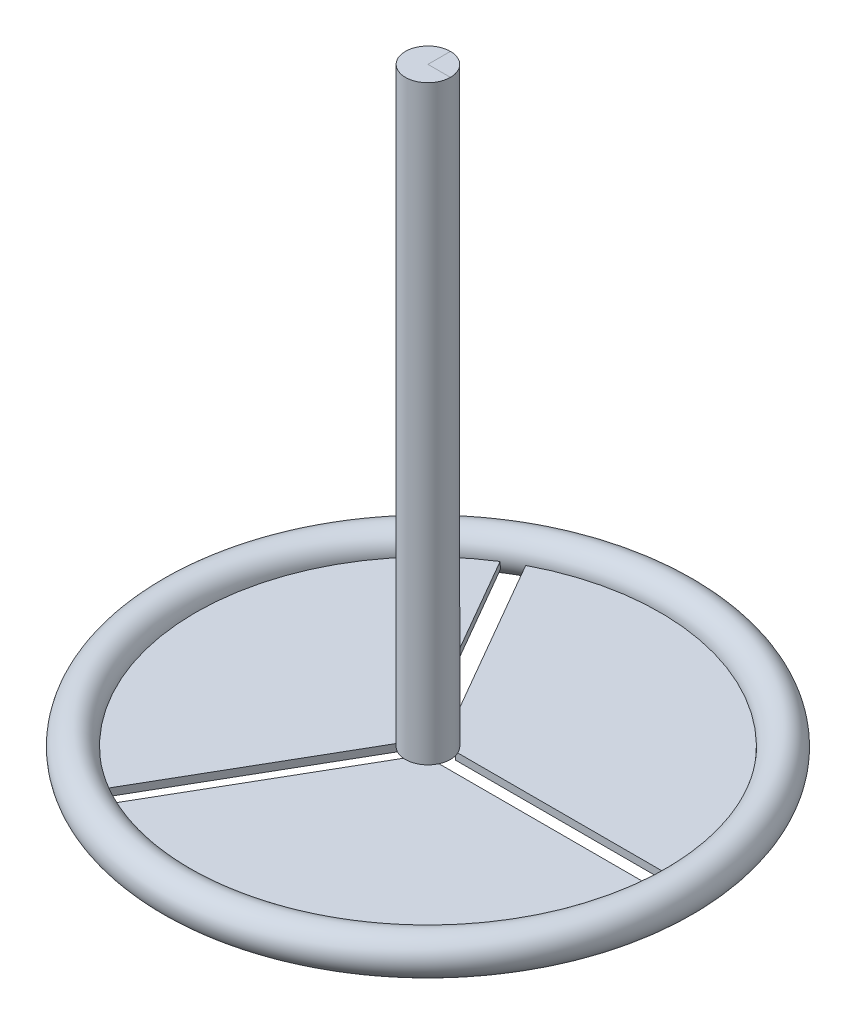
ISO-10303-21;
HEADER;
FILE_DESCRIPTION(('STEP AP214'),'2;1');
FILE_NAME('part.step','',(''),(''),'','','');
FILE_SCHEMA(('AUTOMOTIVE_DESIGN { 1 0 10303 214 1 1 1 1 }'));
ENDSEC;
DATA;
#1=APPLICATION_CONTEXT('core data for automotive mechanical design processes');
#2=APPLICATION_PROTOCOL_DEFINITION('international standard','automotive_design',2000,#1);
#3=PRODUCT_CONTEXT('',#1,'mechanical');
#4=PRODUCT('Part','Part','',(#3));
#5=PRODUCT_RELATED_PRODUCT_CATEGORY('part','',(#4));
#6=PRODUCT_DEFINITION_FORMATION('','',#4);
#7=PRODUCT_DEFINITION_CONTEXT('part definition',#1,'design');
#8=PRODUCT_DEFINITION('design','',#6,#7);
#9=PRODUCT_DEFINITION_SHAPE('','',#8);
#10=(LENGTH_UNIT() NAMED_UNIT(*) SI_UNIT(.MILLI.,.METRE.));
#11=(NAMED_UNIT(*) PLANE_ANGLE_UNIT() SI_UNIT($,.RADIAN.));
#12=(NAMED_UNIT(*) SI_UNIT($,.STERADIAN.) SOLID_ANGLE_UNIT());
#13=UNCERTAINTY_MEASURE_WITH_UNIT(LENGTH_MEASURE(1.E-05),#10,'distance_accuracy_value','');
#14=(GEOMETRIC_REPRESENTATION_CONTEXT(3) GLOBAL_UNCERTAINTY_ASSIGNED_CONTEXT((#13)) GLOBAL_UNIT_ASSIGNED_CONTEXT((#10,
#11,#12)) REPRESENTATION_CONTEXT('',''));
#15=CARTESIAN_POINT('',(0.,0.,0.));
#16=DIRECTION('',(0.,0.,1.));
#17=DIRECTION('',(1.,0.,0.));
#18=AXIS2_PLACEMENT_3D('',#15,#16,#17);
#19=CARTESIAN_POINT('',(0.,400.05,0.));
#20=DIRECTION('',(0.,1.,0.));
#21=DIRECTION('',(0.,0.,1.));
#22=AXIS2_PLACEMENT_3D('',#19,#20,#21);
#23=PLANE('',#22);
#24=DIRECTION('',(-1.,0.,0.));
#25=VECTOR('',#24,1.);
#26=CARTESIAN_POINT('',(0.,400.05,0.));
#27=LINE('',#26,#25);
#28=CARTESIAN_POINT('',(15.24,400.05,0.));
#29=VERTEX_POINT('',#28);
#30=CARTESIAN_POINT('',(0.,400.05,0.));
#31=VERTEX_POINT('',#30);
#32=EDGE_CURVE('E45',#29,#31,#27,.T.);
#33=ORIENTED_EDGE('',*,*,#32,.T.);
#34=DIRECTION('',(0.,0.,-1.));
#35=VECTOR('',#34,1.);
#36=CARTESIAN_POINT('',(0.,400.05,0.));
#37=LINE('',#36,#35);
#38=CARTESIAN_POINT('',(0.,400.05,-15.24));
#39=VERTEX_POINT('',#38);
#40=EDGE_CURVE('E11',#31,#39,#37,.T.);
#41=ORIENTED_EDGE('',*,*,#40,.T.);
#42=CARTESIAN_POINT('',(0.,400.05,0.));
#43=DIRECTION('',(0.,1.,0.));
#44=DIRECTION('',(0.,0.,1.));
#45=AXIS2_PLACEMENT_3D('',#42,#43,#44);
#46=CIRCLE('',#45,15.24);
#47=EDGE_CURVE('E490',#39,#29,#46,.T.);
#48=ORIENTED_EDGE('',*,*,#47,.T.);
#49=EDGE_LOOP('',(#33,#41,#48));
#50=FACE_BOUND('',#49,.T.);
#51=ADVANCED_FACE('F36',(#50),#23,.T.);
#52=CARTESIAN_POINT('',(0.,0.,0.));
#53=DIRECTION('',(0.,-1.,0.));
#54=DIRECTION('',(0.,0.,-1.));
#55=AXIS2_PLACEMENT_3D('',#52,#53,#54);
#56=PLANE('',#55);
#57=DIRECTION('',(1.,0.,0.));
#58=VECTOR('',#57,1.);
#59=CARTESIAN_POINT('',(161.232600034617,0.,-6.34959910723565));
#60=LINE('',#59,#58);
#61=CARTESIAN_POINT('',(13.8542481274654,0.,-6.34959910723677));
#62=VERTEX_POINT('',#61);
#63=CARTESIAN_POINT('',(157.171793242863,0.,-6.34959910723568));
#64=VERTEX_POINT('',#63);
#65=EDGE_CURVE('E191',#62,#64,#60,.T.);
#66=ORIENTED_EDGE('',*,*,#65,.T.);
#67=CARTESIAN_POINT('',(0.,0.,0.));
#68=DIRECTION('',(0.,1.,0.));
#69=DIRECTION('',(0.,0.,1.));
#70=AXIS2_PLACEMENT_3D('',#67,#68,#69);
#71=CIRCLE('',#70,157.3);
#72=CARTESIAN_POINT('',(-73.0869824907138,0.,-139.289565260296));
#73=VERTEX_POINT('',#72);
#74=EDGE_CURVE('E171',#64,#73,#71,.T.);
#75=ORIENTED_EDGE('',*,*,#74,.T.);
#76=DIRECTION('',(0.499999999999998,0.,0.86602540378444));
#77=VECTOR('',#76,1.);
#78=CARTESIAN_POINT('',(-75.0460333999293,0.,-142.682740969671));
#79=LINE('',#78,#77);
#80=CARTESIAN_POINT('',(-1.42820993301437,0.,-15.1729303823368));
#81=VERTEX_POINT('',#80);
#82=EDGE_CURVE('E189',#73,#81,#79,.T.);
#83=ORIENTED_EDGE('',*,*,#82,.T.);
#84=CARTESIAN_POINT('',(0.,0.,0.));
#85=DIRECTION('',(0.,1.,0.));
#86=DIRECTION('',(0.,0.,1.));
#87=AXIS2_PLACEMENT_3D('',#84,#85,#86);
#88=CIRCLE('',#87,15.24);
#89=EDGE_CURVE('E160',#62,#81,#88,.T.);
#90=ORIENTED_EDGE('',*,*,#89,.F.);
#91=EDGE_LOOP('',(#66,#75,#83,#90));
#92=FACE_BOUND('',#91,.T.);
#93=ADVANCED_FACE('F302',(#92),#56,.F.);
#94=DIRECTION('',(-0.499999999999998,0.,-0.86602540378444));
#95=VECTOR('',#94,1.);
#96=CARTESIAN_POINT('',(-86.115214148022,0.,-136.456727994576));
#97=LINE('',#96,#95);
#98=CARTESIAN_POINT('',(-12.4260381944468,0.,-8.82333127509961));
#99=VERTEX_POINT('',#98);
#100=CARTESIAN_POINT('',(-84.0848107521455,0.,-132.939966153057));
#101=VERTEX_POINT('',#100);
#102=EDGE_CURVE('E502',#99,#101,#97,.T.);
#103=ORIENTED_EDGE('',*,*,#102,.T.);
#104=CARTESIAN_POINT('',(-84.0848107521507,0.,132.939966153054));
#105=VERTEX_POINT('',#104);
#106=EDGE_CURVE('E170',#101,#105,#71,.T.);
#107=ORIENTED_EDGE('',*,*,#106,.T.);
#108=DIRECTION('',(0.500000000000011,0.,-0.866025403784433));
#109=VECTOR('',#108,1.);
#110=CARTESIAN_POINT('',(-86.0438616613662,0.,136.333141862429));
#111=LINE('',#110,#109);
#112=CARTESIAN_POINT('',(-12.4260381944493,0.,8.82333127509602));
#113=VERTEX_POINT('',#112);
#114=EDGE_CURVE('E196',#105,#113,#111,.T.);
#115=ORIENTED_EDGE('',*,*,#114,.T.);
#116=EDGE_CURVE('E484',#99,#113,#88,.T.);
#117=ORIENTED_EDGE('',*,*,#116,.F.);
#118=EDGE_LOOP('',(#103,#107,#115,#117));
#119=FACE_BOUND('',#118,.T.);
#120=ADVANCED_FACE('F306',(#119),#56,.F.);
#121=CARTESIAN_POINT('',(0.,-5.00000000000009,0.));
#122=DIRECTION('',(0.,-1.,0.));
#123=DIRECTION('',(0.,0.,-1.));
#124=AXIS2_PLACEMENT_3D('',#121,#122,#123);
#125=PLANE('',#124);
#126=CARTESIAN_POINT('',(0.,-5.00000000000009,0.));
#127=DIRECTION('',(0.,1.,0.));
#128=DIRECTION('',(0.,0.,1.));
#129=AXIS2_PLACEMENT_3D('',#126,#127,#128);
#130=CIRCLE('',#129,158.32566918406);
#131=CARTESIAN_POINT('',(158.198293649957,-5.00000000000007,-6.34959910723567));
#132=VERTEX_POINT('',#131);
#133=CARTESIAN_POINT('',(-73.6002326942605,-5.00000000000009,-140.178540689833));
#134=VERTEX_POINT('',#133);
#135=EDGE_CURVE('E465',#132,#134,#130,.T.);
#136=ORIENTED_EDGE('',*,*,#135,.F.);
#137=DIRECTION('',(1.,0.,0.));
#138=VECTOR('',#137,1.);
#139=CARTESIAN_POINT('',(161.232600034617,-5.00000000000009,-6.34959910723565));
#140=LINE('',#139,#138);
#141=CARTESIAN_POINT('',(12.4436124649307,-5.00000000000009,-6.34959910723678));
#142=VERTEX_POINT('',#141);
#143=EDGE_CURVE('E185',#142,#132,#140,.T.);
#144=ORIENTED_EDGE('',*,*,#143,.F.);
#145=CARTESIAN_POINT('',(0.,-5.00000000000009,0.));
#146=DIRECTION('',(0.,-1.,0.));
#147=DIRECTION('',(0.,0.,-1.));
#148=AXIS2_PLACEMENT_3D('',#145,#146,#147);
#149=CIRCLE('',#148,13.97);
#150=CARTESIAN_POINT('',(-0.722892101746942,-5.00000000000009,-13.9512840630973));
#151=VERTEX_POINT('',#150);
#152=EDGE_CURVE('E209',#151,#142,#149,.T.);
#153=ORIENTED_EDGE('',*,*,#152,.F.);
#154=DIRECTION('',(0.499999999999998,0.,0.86602540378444));
#155=VECTOR('',#154,1.);
#156=CARTESIAN_POINT('',(-75.0460333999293,-5.00000000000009,-142.682740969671));
#157=LINE('',#156,#155);
#158=EDGE_CURVE('E506',#134,#151,#157,.T.);
#159=ORIENTED_EDGE('',*,*,#158,.F.);
#160=EDGE_LOOP('',(#136,#144,#153,#159));
#161=FACE_BOUND('',#160,.T.);
#162=ADVANCED_FACE('F347',(#161),#125,.T.);
#163=CARTESIAN_POINT('',(-84.5980609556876,-4.99999999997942,-133.828941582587));
#164=VERTEX_POINT('',#163);
#165=CARTESIAN_POINT('',(-84.5980609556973,-5.00000000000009,133.828941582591));
#166=VERTEX_POINT('',#165);
#167=EDGE_CURVE('E272',#164,#166,#130,.T.);
#168=ORIENTED_EDGE('',*,*,#167,.F.);
#169=DIRECTION('',(-0.499999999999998,0.,-0.86602540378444));
#170=VECTOR('',#169,1.);
#171=CARTESIAN_POINT('',(-86.115214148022,-5.00000000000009,-136.456727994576));
#172=LINE('',#171,#170);
#173=CARTESIAN_POINT('',(-11.7207203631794,-5.00000000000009,-7.60168495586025));
#174=VERTEX_POINT('',#173);
#175=EDGE_CURVE('E504',#174,#164,#172,.T.);
#176=ORIENTED_EDGE('',*,*,#175,.F.);
#177=CARTESIAN_POINT('',(-11.7207203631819,-5.00000000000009,7.60168495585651));
#178=VERTEX_POINT('',#177);
#179=EDGE_CURVE('E206',#178,#174,#149,.T.);
#180=ORIENTED_EDGE('',*,*,#179,.F.);
#181=DIRECTION('',(0.500000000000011,0.,-0.866025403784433));
#182=VECTOR('',#181,1.);
#183=CARTESIAN_POINT('',(-86.0438616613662,-5.00000000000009,136.333141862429));
#184=LINE('',#183,#182);
#185=EDGE_CURVE('E179',#166,#178,#184,.T.);
#186=ORIENTED_EDGE('',*,*,#185,.F.);
#187=EDGE_LOOP('',(#168,#176,#180,#186));
#188=FACE_BOUND('',#187,.T.);
#189=ADVANCED_FACE('F341',(#188),#125,.T.);
#190=DIRECTION('',(-0.500000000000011,0.,0.866025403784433));
#191=VECTOR('',#190,1.);
#192=CARTESIAN_POINT('',(-75.1173858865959,0.,142.806327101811));
#193=LINE('',#192,#191);
#194=CARTESIAN_POINT('',(-1.42820993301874,0.,15.1729303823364));
#195=VERTEX_POINT('',#194);
#196=CARTESIAN_POINT('',(-73.0869824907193,0.,139.289565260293));
#197=VERTEX_POINT('',#196);
#198=EDGE_CURVE('E167',#195,#197,#193,.T.);
#199=ORIENTED_EDGE('',*,*,#198,.T.);
#200=CARTESIAN_POINT('',(157.171793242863,0.,6.34959910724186));
#201=VERTEX_POINT('',#200);
#202=EDGE_CURVE('E153',#197,#201,#71,.T.);
#203=ORIENTED_EDGE('',*,*,#202,.T.);
#204=DIRECTION('',(-1.,0.,0.));
#205=VECTOR('',#204,1.);
#206=CARTESIAN_POINT('',(161.089895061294,0.,6.34959910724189));
#207=LINE('',#206,#205);
#208=CARTESIAN_POINT('',(13.8542481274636,0.,6.34959910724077));
#209=VERTEX_POINT('',#208);
#210=EDGE_CURVE('E164',#201,#209,#207,.T.);
#211=ORIENTED_EDGE('',*,*,#210,.T.);
#212=EDGE_CURVE('E226',#195,#209,#88,.T.);
#213=ORIENTED_EDGE('',*,*,#212,.F.);
#214=EDGE_LOOP('',(#199,#203,#211,#213));
#215=FACE_BOUND('',#214,.T.);
#216=ADVANCED_FACE('F38',(#215),#56,.F.);
#217=CARTESIAN_POINT('',(0.,0.,0.));
#218=DIRECTION('',(0.,-1.,0.));
#219=DIRECTION('',(0.,0.,-1.));
#220=AXIS2_PLACEMENT_3D('',#217,#218,#219);
#221=CYLINDRICAL_SURFACE('',#220,13.97);
#222=ORIENTED_EDGE('',*,*,#152,.T.);
#223=DIRECTION('',(0.,-1.,0.));
#224=VECTOR('',#223,1.);
#225=CARTESIAN_POINT('',(12.4436124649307,0.,-6.34959910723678));
#226=LINE('',#225,#224);
#227=CARTESIAN_POINT('',(12.4436124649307,0.,-6.34959910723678));
#228=VERTEX_POINT('',#227);
#229=EDGE_CURVE('E224',#142,#228,#226,.F.);
#230=ORIENTED_EDGE('',*,*,#229,.T.);
#231=CARTESIAN_POINT('',(0.,0.,0.));
#232=DIRECTION('',(0.,-1.,0.));
#233=DIRECTION('',(0.,0.,-1.));
#234=AXIS2_PLACEMENT_3D('',#231,#232,#233);
#235=CIRCLE('',#234,13.97);
#236=CARTESIAN_POINT('',(-0.722892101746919,0.,-13.9512840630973));
#237=VERTEX_POINT('',#236);
#238=EDGE_CURVE('E204',#237,#228,#235,.T.);
#239=ORIENTED_EDGE('',*,*,#238,.F.);
#240=DIRECTION('',(0.,-1.,0.));
#241=VECTOR('',#240,1.);
#242=CARTESIAN_POINT('',(-0.722892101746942,0.,-13.9512840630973));
#243=LINE('',#242,#241);
#244=EDGE_CURVE('E215',#237,#151,#243,.T.);
#245=ORIENTED_EDGE('',*,*,#244,.T.);
#246=EDGE_LOOP('',(#222,#230,#239,#245));
#247=FACE_BOUND('',#246,.T.);
#248=ADVANCED_FACE('F380',(#247),#221,.F.);
#249=ORIENTED_EDGE('',*,*,#179,.T.);
#250=DIRECTION('',(0.,-1.,0.));
#251=VECTOR('',#250,1.);
#252=CARTESIAN_POINT('',(-11.7207203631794,0.,-7.60168495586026));
#253=LINE('',#252,#251);
#254=CARTESIAN_POINT('',(-11.7207203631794,0.,-7.60168495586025));
#255=VERTEX_POINT('',#254);
#256=EDGE_CURVE('E218',#174,#255,#253,.F.);
#257=ORIENTED_EDGE('',*,*,#256,.T.);
#258=CARTESIAN_POINT('',(-11.7207203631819,0.,7.60168495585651));
#259=VERTEX_POINT('',#258);
#260=EDGE_CURVE('E200',#259,#255,#235,.T.);
#261=ORIENTED_EDGE('',*,*,#260,.F.);
#262=DIRECTION('',(0.,-1.,0.));
#263=VECTOR('',#262,1.);
#264=CARTESIAN_POINT('',(-11.7207203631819,0.,7.60168495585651));
#265=LINE('',#264,#263);
#266=EDGE_CURVE('E203',#259,#178,#265,.T.);
#267=ORIENTED_EDGE('',*,*,#266,.T.);
#268=EDGE_LOOP('',(#249,#257,#261,#267));
#269=FACE_BOUND('',#268,.T.);
#270=ADVANCED_FACE('F381',(#269),#221,.F.);
#271=CARTESIAN_POINT('',(-73.6002326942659,-5.00000000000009,140.17854068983));
#272=VERTEX_POINT('',#271);
#273=CARTESIAN_POINT('',(158.198293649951,-5.00000000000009,6.34959910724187));
#274=VERTEX_POINT('',#273);
#275=EDGE_CURVE('E156',#272,#274,#130,.T.);
#276=ORIENTED_EDGE('',*,*,#275,.F.);
#277=DIRECTION('',(-0.500000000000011,0.,0.866025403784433));
#278=VECTOR('',#277,1.);
#279=CARTESIAN_POINT('',(-75.1173858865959,-5.00000000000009,142.806327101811));
#280=LINE('',#279,#278);
#281=CARTESIAN_POINT('',(-0.722892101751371,-5.00000000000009,13.9512840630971));
#282=VERTEX_POINT('',#281);
#283=EDGE_CURVE('E176',#282,#272,#280,.T.);
#284=ORIENTED_EDGE('',*,*,#283,.F.);
#285=CARTESIAN_POINT('',(12.4436124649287,-5.00000000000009,6.34959910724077));
#286=VERTEX_POINT('',#285);
#287=EDGE_CURVE('E197',#286,#282,#149,.T.);
#288=ORIENTED_EDGE('',*,*,#287,.F.);
#289=DIRECTION('',(-1.,0.,0.));
#290=VECTOR('',#289,1.);
#291=CARTESIAN_POINT('',(161.089895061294,-5.00000000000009,6.34959910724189));
#292=LINE('',#291,#290);
#293=EDGE_CURVE('E188',#274,#286,#292,.T.);
#294=ORIENTED_EDGE('',*,*,#293,.F.);
#295=EDGE_LOOP('',(#276,#284,#288,#294));
#296=FACE_BOUND('',#295,.T.);
#297=ADVANCED_FACE('F349',(#296),#125,.T.);
#298=CARTESIAN_POINT('',(12.4436124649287,0.,6.34959910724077));
#299=VERTEX_POINT('',#298);
#300=CARTESIAN_POINT('',(-0.722892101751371,0.,13.9512840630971));
#301=VERTEX_POINT('',#300);
#302=EDGE_CURVE('E205',#299,#301,#235,.T.);
#303=ORIENTED_EDGE('',*,*,#302,.F.);
#304=DIRECTION('',(0.,-1.,0.));
#305=VECTOR('',#304,1.);
#306=CARTESIAN_POINT('',(12.4436124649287,0.,6.34959910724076));
#307=LINE('',#306,#305);
#308=EDGE_CURVE('E221',#299,#286,#307,.T.);
#309=ORIENTED_EDGE('',*,*,#308,.T.);
#310=ORIENTED_EDGE('',*,*,#287,.T.);
#311=DIRECTION('',(0.,-1.,0.));
#312=VECTOR('',#311,1.);
#313=CARTESIAN_POINT('',(-0.722892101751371,0.,13.9512840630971));
#314=LINE('',#313,#312);
#315=EDGE_CURVE('E212',#282,#301,#314,.F.);
#316=ORIENTED_EDGE('',*,*,#315,.T.);
#317=EDGE_LOOP('',(#303,#309,#310,#316));
#318=FACE_BOUND('',#317,.T.);
#319=ADVANCED_FACE('F372',(#318),#221,.F.);
#320=CARTESIAN_POINT('',(-75.1173858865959,0.,142.806327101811));
#321=DIRECTION('',(0.866025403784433,0.,0.500000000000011));
#322=DIRECTION('',(0.500000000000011,0.,-0.866025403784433));
#323=AXIS2_PLACEMENT_3D('',#320,#321,#322);
#324=PLANE('',#323);
#325=ORIENTED_EDGE('',*,*,#283,.T.);
#326=CARTESIAN_POINT('',(-73.6002755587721,-5.00020000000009,140.178614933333));
#327=CARTESIAN_POINT('',(-73.5293948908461,-4.66959465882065,140.055846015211));
#328=CARTESIAN_POINT('',(-73.4655773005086,-4.33292979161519,139.94531070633));
#329=CARTESIAN_POINT('',(-73.3524152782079,-3.6497825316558,139.749308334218));
#330=CARTESIAN_POINT('',(-73.3030795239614,-3.30329438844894,139.663856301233));
#331=CARTESIAN_POINT('',(-73.2200143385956,-2.60905785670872,139.519983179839));
#332=CARTESIAN_POINT('',(-73.18603769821,-2.2614274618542,139.461133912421));
#333=CARTESIAN_POINT('',(-73.1327455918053,-1.56189652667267,139.368829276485));
#334=CARTESIAN_POINT('',(-73.1134197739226,-1.20999918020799,139.335355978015));
#335=CARTESIAN_POINT('',(-73.0966525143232,-0.714754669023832,139.306314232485));
#336=CARTESIAN_POINT('',(-73.0930330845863,-0.572158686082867,139.300045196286));
#337=CARTESIAN_POINT('',(-73.0881935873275,-0.286314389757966,139.291662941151));
#338=CARTESIAN_POINT('',(-73.0869817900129,-0.143065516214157,139.289564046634));
#339=CARTESIAN_POINT('',(-73.0869824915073,0.000199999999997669,139.289565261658));
#340=B_SPLINE_CURVE_WITH_KNOTS('',3,(#326,#327,#328,#329,#330,#331,#332,#333,#334,#335,#336,
#337,#338,#339),.UNSPECIFIED.,.F.,.F.,(4,2,2,2,2,2,4),(0.,1.07883504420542,2.15831522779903,
3.21974157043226,4.28041723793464,4.7086913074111,5.13843397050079),.UNSPECIFIED.);
#341=EDGE_CURVE('E168',#272,#197,#340,.T.);
#342=ORIENTED_EDGE('',*,*,#341,.T.);
#343=ORIENTED_EDGE('',*,*,#198,.F.);
#344=EDGE_CURVE('E192',#301,#195,#193,.T.);
#345=ORIENTED_EDGE('',*,*,#344,.F.);
#346=ORIENTED_EDGE('',*,*,#315,.F.);
#347=EDGE_LOOP('',(#325,#342,#343,#345,#346));
#348=FACE_BOUND('',#347,.T.);
#349=ADVANCED_FACE('F377',(#348),#324,.F.);
#350=CARTESIAN_POINT('',(-86.0438616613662,0.,136.333141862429));
#351=DIRECTION('',(-0.866025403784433,0.,-0.500000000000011));
#352=DIRECTION('',(-0.500000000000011,0.,0.866025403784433));
#353=AXIS2_PLACEMENT_3D('',#350,#351,#352);
#354=PLANE('',#353);
#355=ORIENTED_EDGE('',*,*,#114,.F.);
#356=CARTESIAN_POINT('',(-84.0848107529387,0.0002,132.939966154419));
#357=CARTESIAN_POINT('',(-84.0847869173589,-0.359517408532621,132.939924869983));
#358=CARTESIAN_POINT('',(-84.0924517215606,-0.719238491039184,132.953200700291));
#359=CARTESIAN_POINT('',(-84.1230214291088,-1.43629748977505,133.006148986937));
#360=CARTESIAN_POINT('',(-84.1459353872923,-1.79363386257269,133.045837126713));
#361=CARTESIAN_POINT('',(-84.2063564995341,-2.49716768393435,133.150489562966));
#362=CARTESIAN_POINT('',(-84.2436132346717,-2.84345147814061,133.215020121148));
#363=CARTESIAN_POINT('',(-84.3324416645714,-3.52839166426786,133.368875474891));
#364=CARTESIAN_POINT('',(-84.3840032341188,-3.8670532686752,133.458182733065));
#365=CARTESIAN_POINT('',(-84.4661532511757,-4.33545242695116,133.60047073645));
#366=CARTESIAN_POINT('',(-84.490917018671,-4.46936659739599,133.643362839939));
#367=CARTESIAN_POINT('',(-84.5427775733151,-4.73590441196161,133.733187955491));
#368=CARTESIAN_POINT('',(-84.569882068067,-4.86852205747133,133.780134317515));
#369=CARTESIAN_POINT('',(-84.5981038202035,-5.00020000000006,133.829015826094));
#370=B_SPLINE_CURVE_WITH_KNOTS('',3,(#356,#357,#358,#359,#360,#361,#362,#363,#364,#365,#366,
#367,#368,#369),.UNSPECIFIED.,.F.,.F.,(4,2,2,2,2,2,4),(0.,1.07883590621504,2.15831298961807,
3.2197401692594,4.28041796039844,4.70869172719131,5.13843381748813),.UNSPECIFIED.);
#371=EDGE_CURVE('E273',#105,#166,#370,.T.);
#372=ORIENTED_EDGE('',*,*,#371,.T.);
#373=ORIENTED_EDGE('',*,*,#185,.T.);
#374=ORIENTED_EDGE('',*,*,#266,.F.);
#375=EDGE_CURVE('E195',#113,#259,#111,.T.);
#376=ORIENTED_EDGE('',*,*,#375,.F.);
#377=EDGE_LOOP('',(#355,#372,#373,#374,#376));
#378=FACE_BOUND('',#377,.T.);
#379=ADVANCED_FACE('F289',(#378),#354,.F.);
#380=CARTESIAN_POINT('',(-75.0460333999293,0.,-142.682740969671));
#381=DIRECTION('',(0.86602540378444,0.,-0.499999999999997));
#382=DIRECTION('',(-0.499999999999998,0.,-0.86602540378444));
#383=AXIS2_PLACEMENT_3D('',#380,#381,#382);
#384=PLANE('',#383);
#385=ORIENTED_EDGE('',*,*,#82,.F.);
#386=CARTESIAN_POINT('',(-73.0869824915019,0.0002,-139.28956526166));
#387=CARTESIAN_POINT('',(-73.0869586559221,-0.359517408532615,-139.289523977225));
#388=CARTESIAN_POINT('',(-73.0946234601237,-0.719238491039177,-139.302799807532));
#389=CARTESIAN_POINT('',(-73.125193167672,-1.43629748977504,-139.355748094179));
#390=CARTESIAN_POINT('',(-73.1481071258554,-1.79363386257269,-139.395436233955));
#391=CARTESIAN_POINT('',(-73.2085282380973,-2.49716768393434,-139.500088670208));
#392=CARTESIAN_POINT('',(-73.2457849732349,-2.84345147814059,-139.56461922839));
#393=CARTESIAN_POINT('',(-73.3346134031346,-3.52839166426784,-139.718474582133));
#394=CARTESIAN_POINT('',(-73.386174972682,-3.86705326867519,-139.807781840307));
#395=CARTESIAN_POINT('',(-73.4683249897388,-4.33545242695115,-139.950069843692));
#396=CARTESIAN_POINT('',(-73.4930887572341,-4.46936659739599,-139.992961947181));
#397=CARTESIAN_POINT('',(-73.5449493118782,-4.73590441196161,-140.082787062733));
#398=CARTESIAN_POINT('',(-73.5720538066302,-4.86852205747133,-140.129733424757));
#399=CARTESIAN_POINT('',(-73.6002755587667,-5.00020000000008,-140.178614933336));
#400=B_SPLINE_CURVE_WITH_KNOTS('',3,(#386,#387,#388,#389,#390,#391,#392,#393,#394,#395,#396,
#397,#398,#399),.UNSPECIFIED.,.F.,.F.,(4,2,2,2,2,2,4),(0.,1.07883590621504,2.15831298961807,
3.21974016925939,4.28041796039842,4.70869172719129,5.13843381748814),.UNSPECIFIED.);
#401=EDGE_CURVE('E259',#73,#134,#400,.T.);
#402=ORIENTED_EDGE('',*,*,#401,.T.);
#403=ORIENTED_EDGE('',*,*,#158,.T.);
#404=ORIENTED_EDGE('',*,*,#244,.F.);
#405=EDGE_CURVE('E498',#81,#237,#79,.T.);
#406=ORIENTED_EDGE('',*,*,#405,.F.);
#407=EDGE_LOOP('',(#385,#402,#403,#404,#406));
#408=FACE_BOUND('',#407,.T.);
#409=ADVANCED_FACE('F284',(#408),#384,.F.);
#410=CARTESIAN_POINT('',(-86.115214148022,0.,-136.456727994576));
#411=DIRECTION('',(-0.86602540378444,0.,0.499999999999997));
#412=DIRECTION('',(0.499999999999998,0.,0.86602540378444));
#413=AXIS2_PLACEMENT_3D('',#410,#411,#412);
#414=PLANE('',#413);
#415=ORIENTED_EDGE('',*,*,#175,.T.);
#416=CARTESIAN_POINT('',(-84.5981038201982,-5.00020000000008,-133.829015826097));
#417=CARTESIAN_POINT('',(-84.5272231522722,-4.66959465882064,-133.706246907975));
#418=CARTESIAN_POINT('',(-84.4634055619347,-4.33292979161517,-133.595711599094));
#419=CARTESIAN_POINT('',(-84.3502435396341,-3.64978253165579,-133.399709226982));
#420=CARTESIAN_POINT('',(-84.3009077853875,-3.30329438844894,-133.314257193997));
#421=CARTESIAN_POINT('',(-84.2178426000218,-2.60905785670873,-133.170384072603));
#422=CARTESIAN_POINT('',(-84.1838659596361,-2.26142746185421,-133.111534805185));
#423=CARTESIAN_POINT('',(-84.1305738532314,-1.56189652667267,-133.01923016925));
#424=CARTESIAN_POINT('',(-84.1112480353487,-1.20999918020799,-132.985756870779));
#425=CARTESIAN_POINT('',(-84.0944807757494,-0.714754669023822,-132.956715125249));
#426=CARTESIAN_POINT('',(-84.0908613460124,-0.572158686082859,-132.950446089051));
#427=CARTESIAN_POINT('',(-84.0860218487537,-0.286314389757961,-132.942063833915));
#428=CARTESIAN_POINT('',(-84.084810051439,-0.143065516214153,-132.939964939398));
#429=CARTESIAN_POINT('',(-84.0848107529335,0.000200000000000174,-132.939966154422));
#430=B_SPLINE_CURVE_WITH_KNOTS('',3,(#416,#417,#418,#419,#420,#421,#422,#423,#424,#425,#426,
#427,#428,#429),.UNSPECIFIED.,.F.,.F.,(4,2,2,2,2,2,4),(0.,1.07883504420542,2.15831522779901,
3.21974157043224,4.28041723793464,4.7086913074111,5.13843397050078),.UNSPECIFIED.);
#431=EDGE_CURVE('E266',#164,#101,#430,.T.);
#432=ORIENTED_EDGE('',*,*,#431,.T.);
#433=ORIENTED_EDGE('',*,*,#102,.F.);
#434=EDGE_CURVE('E500',#255,#99,#97,.T.);
#435=ORIENTED_EDGE('',*,*,#434,.F.);
#436=ORIENTED_EDGE('',*,*,#256,.F.);
#437=EDGE_LOOP('',(#415,#432,#433,#435,#436));
#438=FACE_BOUND('',#437,.T.);
#439=ADVANCED_FACE('F280',(#438),#414,.F.);
#440=CARTESIAN_POINT('',(161.232600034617,0.,-6.34959910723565));
#441=DIRECTION('',(0.,0.,-1.));
#442=DIRECTION('',(-1.,0.,0.));
#443=AXIS2_PLACEMENT_3D('',#440,#441,#442);
#444=PLANE('',#443);
#445=ORIENTED_EDGE('',*,*,#143,.T.);
#446=CARTESIAN_POINT('',(157.390886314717,-2.34787371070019,-6.34959910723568));
#447=CARTESIAN_POINT('',(157.324916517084,-1.99748321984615,-6.34959910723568));
#448=CARTESIAN_POINT('',(157.273732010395,-1.64435208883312,-6.34959910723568));
#449=CARTESIAN_POINT('',(157.201258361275,-0.934919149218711,-6.34959910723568));
#450=CARTESIAN_POINT('',(157.179977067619,-0.578616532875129,-6.34959910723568));
#451=CARTESIAN_POINT('',(157.167488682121,0.134892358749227,-6.34959910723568));
#452=CARTESIAN_POINT('',(157.176313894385,0.492099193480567,-6.34959910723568));
#453=CARTESIAN_POINT('',(157.224044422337,1.20449770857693,-6.34959910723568));
#454=CARTESIAN_POINT('',(157.262949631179,1.55968939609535,-6.34959910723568));
#455=CARTESIAN_POINT('',(157.370535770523,2.26535548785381,-6.34959910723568));
#456=CARTESIAN_POINT('',(157.439202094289,2.61583211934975,-6.34959910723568));
#457=CARTESIAN_POINT('',(157.605818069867,3.30976015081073,-6.34959910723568));
#458=CARTESIAN_POINT('',(157.703768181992,3.65321144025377,-6.34959910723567));
#459=CARTESIAN_POINT('',(157.928223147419,4.3305561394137,-6.34959910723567));
#460=CARTESIAN_POINT('',(158.054720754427,4.66445195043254,-6.34959910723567));
#461=CARTESIAN_POINT('',(158.335381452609,5.32040484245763,-6.34959910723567));
#462=CARTESIAN_POINT('',(158.489544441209,5.64246196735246,-6.34959910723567));
#463=CARTESIAN_POINT('',(158.824485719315,6.27254565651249,-6.34959910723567));
#464=CARTESIAN_POINT('',(159.005271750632,6.580568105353,-6.34959910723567));
#465=CARTESIAN_POINT('',(159.392136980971,7.18029744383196,-6.34959910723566));
#466=CARTESIAN_POINT('',(159.598216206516,7.47200431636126,-6.34959910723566));
#467=CARTESIAN_POINT('',(160.034208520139,8.03704581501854,-6.34959910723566));
#468=CARTESIAN_POINT('',(160.264122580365,8.31037969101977,-6.34959910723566));
#469=CARTESIAN_POINT('',(160.746140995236,8.83672579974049,-6.34959910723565));
#470=CARTESIAN_POINT('',(160.998245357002,9.08973802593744,-6.34959910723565));
#471=CARTESIAN_POINT('',(161.523020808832,9.57380598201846,-6.34959910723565));
#472=CARTESIAN_POINT('',(161.79570506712,9.80484743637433,-6.34959910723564));
#473=CARTESIAN_POINT('',(162.359556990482,10.2431524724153,-6.34959910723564));
#474=CARTESIAN_POINT('',(162.650724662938,10.4504160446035,-6.34959910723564));
#475=CARTESIAN_POINT('',(163.249473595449,10.8396983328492,-6.34959910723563));
#476=CARTESIAN_POINT('',(163.557054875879,11.0217170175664,-6.34959910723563));
#477=CARTESIAN_POINT('',(164.186445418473,11.3592214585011,-6.34959910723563));
#478=CARTESIAN_POINT('',(164.508254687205,11.5147072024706,-6.34959910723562));
#479=CARTESIAN_POINT('',(165.164061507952,11.7981520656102,-6.34959910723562));
#480=CARTESIAN_POINT('',(165.498067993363,11.9260905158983,-6.34959910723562));
#481=CARTESIAN_POINT('',(166.175667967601,12.1533874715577,-6.34959910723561));
#482=CARTESIAN_POINT('',(166.519261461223,12.2527459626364,-6.34959910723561));
#483=CARTESIAN_POINT('',(167.213594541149,12.422179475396,-6.3495991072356));
#484=CARTESIAN_POINT('',(167.564334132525,12.4922544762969,-6.3495991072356));
#485=CARTESIAN_POINT('',(168.27046797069,12.6026245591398,-6.34959910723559));
#486=CARTESIAN_POINT('',(168.62586221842,12.6429196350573,-6.34959910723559));
#487=CARTESIAN_POINT('',(169.338949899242,12.6934560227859,-6.34959910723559));
#488=CARTESIAN_POINT('',(169.696644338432,12.70368313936,-6.34959910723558));
#489=CARTESIAN_POINT('',(170.411623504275,12.6939700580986,-6.34959910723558));
#490=CARTESIAN_POINT('',(170.768908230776,12.6740298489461,-6.34959910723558));
#491=CARTESIAN_POINT('',(171.480528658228,12.6041224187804,-6.34959910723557));
#492=CARTESIAN_POINT('',(171.834864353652,12.5541551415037,-6.34959910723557));
#493=CARTESIAN_POINT('',(172.538066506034,12.4245466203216,-6.34959910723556));
#494=CARTESIAN_POINT('',(172.886932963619,12.3449053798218,-6.34959910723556));
#495=CARTESIAN_POINT('',(173.576720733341,12.156510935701,-6.34959910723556));
#496=CARTESIAN_POINT('',(173.917641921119,12.047757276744,-6.34959910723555));
#497=CARTESIAN_POINT('',(174.589107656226,11.8019086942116,-6.34959910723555));
#498=CARTESIAN_POINT('',(174.919652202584,11.6648137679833,-6.34959910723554));
#499=CARTESIAN_POINT('',(175.568011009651,11.36325447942,-6.34959910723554));
#500=CARTESIAN_POINT('',(175.885825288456,11.1987901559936,-6.34959910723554));
#501=CARTESIAN_POINT('',(176.50646029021,10.8436583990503,-6.34959910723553));
#502=CARTESIAN_POINT('',(176.809281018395,10.6529909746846,-6.34959910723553));
#503=CARTESIAN_POINT('',(177.397654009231,10.2468869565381,-6.34959910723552));
#504=CARTESIAN_POINT('',(177.683213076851,10.0314602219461,-6.34959910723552));
#505=CARTESIAN_POINT('',(178.235158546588,9.57730556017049,-6.34959910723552));
#506=CARTESIAN_POINT('',(178.501544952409,9.33857763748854,-6.34959910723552));
#507=CARTESIAN_POINT('',(179.013245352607,8.83951661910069,-6.34959910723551));
#508=CARTESIAN_POINT('',(179.258559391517,8.57918356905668,-6.34959910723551));
#509=CARTESIAN_POINT('',(179.726365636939,8.03876209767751,-6.34959910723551));
#510=CARTESIAN_POINT('',(179.948857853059,7.75867368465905,-6.34959910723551));
#511=CARTESIAN_POINT('',(180.369304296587,7.18090946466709,-6.3495991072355));
#512=CARTESIAN_POINT('',(180.567273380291,6.88324446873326,-6.3495991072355));
#513=CARTESIAN_POINT('',(180.937419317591,6.27228828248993,-6.3495991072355));
#514=CARTESIAN_POINT('',(181.109596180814,5.95899709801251,-6.3495991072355));
#515=CARTESIAN_POINT('',(181.42692858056,5.31901721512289,-6.34959910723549));
#516=CARTESIAN_POINT('',(181.572084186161,4.99232855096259,-6.34959910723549));
#517=CARTESIAN_POINT('',(181.83433826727,4.32787724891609,-6.34959910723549));
#518=CARTESIAN_POINT('',(181.951436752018,3.99011461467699,-6.34959910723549));
#519=CARTESIAN_POINT('',(182.156681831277,3.30611432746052,-6.34959910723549));
#520=CARTESIAN_POINT('',(182.244844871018,2.95988160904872,-6.34959910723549));
#521=CARTESIAN_POINT('',(182.39168133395,2.26121844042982,-6.34959910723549));
#522=CARTESIAN_POINT('',(182.450354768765,1.90878799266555,-6.34959910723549));
#523=CARTESIAN_POINT('',(182.537793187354,1.2002369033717,-6.34959910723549));
#524=CARTESIAN_POINT('',(182.566558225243,0.844116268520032,-6.34959910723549));
#525=CARTESIAN_POINT('',(182.593974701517,0.130717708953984,-6.34959910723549));
#526=CARTESIAN_POINT('',(182.59262614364,-0.22656021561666,-6.34959910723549));
#527=CARTESIAN_POINT('',(182.559830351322,-0.939616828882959,-6.34959910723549));
#528=CARTESIAN_POINT('',(182.528392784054,-1.29539596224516,-6.34959910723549));
#529=CARTESIAN_POINT('',(182.435657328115,-2.00304099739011,-6.34959910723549));
#530=CARTESIAN_POINT('',(182.374359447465,-2.35490690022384,-6.34959910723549));
#531=CARTESIAN_POINT('',(182.222340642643,-3.05222401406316,-6.34959910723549));
#532=CARTESIAN_POINT('',(182.13161973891,-3.3976752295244,-6.34959910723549));
#533=CARTESIAN_POINT('',(181.921401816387,-4.07970818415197,-6.34959910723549));
#534=CARTESIAN_POINT('',(181.80190479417,-4.41628992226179,-6.34959910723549));
#535=CARTESIAN_POINT('',(181.534981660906,-5.07820472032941,-6.34959910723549));
#536=CARTESIAN_POINT('',(181.387554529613,-5.40353736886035,-6.3495991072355));
#537=CARTESIAN_POINT('',(181.065824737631,-6.0406304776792,-6.3495991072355));
#538=CARTESIAN_POINT('',(180.891522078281,-6.35239093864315,-6.3495991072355));
#539=CARTESIAN_POINT('',(180.517282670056,-6.96012701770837,-6.3495991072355));
#540=CARTESIAN_POINT('',(180.317345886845,-7.25610261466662,-6.3495991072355));
#541=CARTESIAN_POINT('',(179.893262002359,-7.83016869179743,-6.34959910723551));
#542=CARTESIAN_POINT('',(179.669114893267,-8.10825916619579,-6.34959910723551));
#543=CARTESIAN_POINT('',(179.198115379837,-8.64468578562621,-6.34959910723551));
#544=CARTESIAN_POINT('',(178.951254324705,-8.90301433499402,-6.34959910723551));
#545=CARTESIAN_POINT('',(178.436656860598,-9.39796738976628,-6.34959910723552));
#546=CARTESIAN_POINT('',(178.168920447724,-9.63459189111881,-6.34959910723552));
#547=CARTESIAN_POINT('',(177.614476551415,-10.0844602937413,-6.34959910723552));
#548=CARTESIAN_POINT('',(177.327769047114,-10.2977041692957,-6.34959910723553));
#549=CARTESIAN_POINT('',(176.737421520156,-10.6993010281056,-6.34959910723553));
#550=CARTESIAN_POINT('',(176.433781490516,-10.8876540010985,-6.34959910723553));
#551=CARTESIAN_POINT('',(175.811541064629,-11.2382405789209,-6.34959910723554));
#552=CARTESIAN_POINT('',(175.492931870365,-11.4004585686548,-6.34959910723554));
#553=CARTESIAN_POINT('',(174.843186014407,-11.6974911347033,-6.34959910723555));
#554=CARTESIAN_POINT('',(174.512049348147,-11.8323057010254,-6.34959910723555));
#555=CARTESIAN_POINT('',(173.83960014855,-12.0735782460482,-6.34959910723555));
#556=CARTESIAN_POINT('',(173.498287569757,-12.1800360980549,-6.34959910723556));
#557=CARTESIAN_POINT('',(172.807912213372,-12.363841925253,-6.34959910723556));
#558=CARTESIAN_POINT('',(172.458849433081,-12.4411898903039,-6.34959910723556));
#559=CARTESIAN_POINT('',(171.755246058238,-12.566266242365,-6.34959910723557));
#560=CARTESIAN_POINT('',(171.400702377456,-12.6139772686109,-6.34959910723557));
#561=CARTESIAN_POINT('',(170.688856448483,-12.6793714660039,-6.34959910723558));
#562=CARTESIAN_POINT('',(170.331554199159,-12.6970546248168,-6.34959910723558));
#563=CARTESIAN_POINT('',(169.616728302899,-12.7022687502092,-6.34959910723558));
#564=CARTESIAN_POINT('',(169.259204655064,-12.6897995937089,-6.34959910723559));
#565=CARTESIAN_POINT('',(168.546477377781,-12.6347978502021,-6.34959910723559));
#566=CARTESIAN_POINT('',(168.19127374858,-12.5922652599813,-6.3495991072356));
#567=CARTESIAN_POINT('',(167.485587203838,-12.4774183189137,-6.3495991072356));
#568=CARTESIAN_POINT('',(167.135105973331,-12.4050936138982,-6.3495991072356));
#569=CARTESIAN_POINT('',(166.441482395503,-12.231174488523,-6.34959910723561));
#570=CARTESIAN_POINT('',(166.098340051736,-12.1295800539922,-6.34959910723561));
#571=CARTESIAN_POINT('',(165.421847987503,-11.8978460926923,-6.34959910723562));
#572=CARTESIAN_POINT('',(165.088497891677,-11.7677076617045,-6.34959910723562));
#573=CARTESIAN_POINT('',(164.433948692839,-11.4798060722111,-6.34959910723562));
#574=CARTESIAN_POINT('',(164.112749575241,-11.3220429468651,-6.34959910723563));
#575=CARTESIAN_POINT('',(163.484855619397,-10.9800470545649,-6.34959910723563));
#576=CARTESIAN_POINT('',(163.178157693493,-10.7958199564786,-6.34959910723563));
#577=CARTESIAN_POINT('',(162.581375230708,-10.4021762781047,-6.34959910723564));
#578=CARTESIAN_POINT('',(162.291290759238,-10.192759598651,-6.34959910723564));
#579=CARTESIAN_POINT('',(161.729732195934,-9.75016674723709,-6.34959910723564));
#580=CARTESIAN_POINT('',(161.458262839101,-9.51698456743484,-6.34959910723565));
#581=CARTESIAN_POINT('',(160.935956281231,-9.02856501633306,-6.34959910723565));
#582=CARTESIAN_POINT('',(160.685118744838,-8.77332800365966,-6.34959910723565));
#583=CARTESIAN_POINT('',(160.205876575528,-8.24262533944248,-6.34959910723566));
#584=CARTESIAN_POINT('',(159.977470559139,-7.96716093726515,-6.34959910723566));
#585=CARTESIAN_POINT('',(159.54470586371,-7.39794955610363,-6.34959910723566));
#586=CARTESIAN_POINT('',(159.340347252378,-7.10420252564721,-6.34959910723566));
#587=CARTESIAN_POINT('',(158.957344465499,-6.50083595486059,-6.34959910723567));
#588=CARTESIAN_POINT('',(158.778672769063,-6.19123389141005,-6.34959910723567));
#589=CARTESIAN_POINT('',(158.44810963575,-5.55817728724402,-6.34959910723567));
#590=CARTESIAN_POINT('',(158.296211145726,-5.23472642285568,-6.34959910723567));
#591=CARTESIAN_POINT('',(157.98589156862,-4.49424751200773,-6.34959910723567));
#592=CARTESIAN_POINT('',(157.835231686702,-4.07394129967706,-6.34959910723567));
#593=CARTESIAN_POINT('',(157.578971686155,-3.2198095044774,-6.34959910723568));
#594=CARTESIAN_POINT('',(157.473371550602,-2.78598392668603,-6.34959910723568));
#595=CARTESIAN_POINT('',(157.390886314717,-2.34787371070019,-6.34959910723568));
#596=B_SPLINE_CURVE_WITH_KNOTS('',3,(#446,#447,#448,#449,#450,#451,#452,#453,#454,#455,#456,
#457,#458,#459,#460,#461,#462,#463,#464,#465,#466,#467,#468,#469,#470,#471,#472,#473,#474,#475,
#476,#477,#478,#479,#480,#481,#482,#483,#484,#485,#486,#487,#488,#489,#490,#491,#492,#493,#494,
#495,#496,#497,#498,#499,#500,#501,#502,#503,#504,#505,#506,#507,#508,#509,#510,#511,#512,#513,
#514,#515,#516,#517,#518,#519,#520,#521,#522,#523,#524,#525,#526,#527,#528,#529,#530,#531,#532,
#533,#534,#535,#536,#537,#538,#539,#540,#541,#542,#543,#544,#545,#546,#547,#548,#549,#550,#551,
#552,#553,#554,#555,#556,#557,#558,#559,#560,#561,#562,#563,#564,#565,#566,#567,#568,#569,#570,
#571,#572,#573,#574,#575,#576,#577,#578,#579,#580,#581,#582,#583,#584,#585,#586,#587,#588,#589,
#590,#591,#592,#593,#594,#595),.UNSPECIFIED.,.T.,.F.,(4,2,2,2,2,2,2,2,2,2,2,2,2,2,2,2,2,2,2,2,2,
2,2,2,2,2,2,2,2,2,2,2,2,2,2,2,2,2,2,2,2,2,2,2,2,2,2,2,2,2,2,2,2,2,2,2,2,2,2,2,2,2,2,2,2,2,2,2,2,
2,2,2,2,2,4),(0.,1.06925055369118,2.13878170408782,3.2094608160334,4.28013612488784,
5.35028654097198,6.42045377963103,7.4903496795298,8.56024161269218,9.63044528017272,
10.7006500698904,11.7708985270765,12.8411473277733,13.9120868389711,14.9830267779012,
16.053968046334,17.1249098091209,18.1966523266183,19.2683953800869,20.340139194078,
21.4118832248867,22.4841331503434,23.5563834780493,24.628635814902,25.700888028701,
26.7731570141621,27.8454260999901,28.9176936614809,29.9899608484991,31.0618025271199,
32.1336439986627,33.2054832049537,34.2773219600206,35.3485081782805,36.4196939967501,
37.4908770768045,38.5620598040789,39.6326326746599,40.7032051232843,41.7737756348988,
42.8443460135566,43.9145725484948,44.9847987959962,46.0550243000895,47.1252499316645,
48.1955146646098,49.2657793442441,50.3360454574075,51.4063119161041,52.476987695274,
53.5476636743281,54.618340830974,55.6890184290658,56.760333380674,57.8316487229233,
58.9029688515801,59.9742893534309,61.0462368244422,62.1181847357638,63.1901370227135,
64.2620894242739,65.3344146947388,66.4067404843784,67.4790251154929,68.5513084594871,
69.6233624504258,70.6954206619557,71.7677505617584,72.8400630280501,73.9123093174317,
74.984558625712,76.0556504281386,77.1264596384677,78.4633959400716,79.800331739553),.UNSPECIFIED.);
#597=EDGE_CURVE('E254',#132,#64,#596,.T.);
#598=ORIENTED_EDGE('',*,*,#597,.T.);
#599=ORIENTED_EDGE('',*,*,#65,.F.);
#600=EDGE_CURVE('E181',#228,#62,#60,.T.);
#601=ORIENTED_EDGE('',*,*,#600,.F.);
#602=ORIENTED_EDGE('',*,*,#229,.F.);
#603=EDGE_LOOP('',(#445,#598,#599,#601,#602));
#604=FACE_BOUND('',#603,.T.);
#605=ADVANCED_FACE('F283',(#604),#444,.F.);
#606=CARTESIAN_POINT('',(161.089895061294,0.,6.34959910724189));
#607=DIRECTION('',(0.,0.,1.));
#608=DIRECTION('',(1.,0.,0.));
#609=AXIS2_PLACEMENT_3D('',#606,#607,#608);
#610=PLANE('',#609);
#611=ORIENTED_EDGE('',*,*,#210,.F.);
#612=CARTESIAN_POINT('',(157.386507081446,-2.32449252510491,6.34959910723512));
#613=CARTESIAN_POINT('',(157.45184331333,-2.67515928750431,6.34959910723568));
#614=CARTESIAN_POINT('',(157.53196739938,-3.0230281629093,6.34959910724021));
#615=CARTESIAN_POINT('',(157.721252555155,-3.71089619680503,6.34959910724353));
#616=CARTESIAN_POINT('',(157.830421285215,-4.05089325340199,6.34959910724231));
#617=CARTESIAN_POINT('',(158.077137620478,-4.7208409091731,6.34959910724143));
#618=CARTESIAN_POINT('',(158.214715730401,-5.05078026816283,6.34959910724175));
#619=CARTESIAN_POINT('',(158.51719497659,-5.69788755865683,6.34959910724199));
#620=CARTESIAN_POINT('',(158.68209602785,-6.01505552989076,6.34959910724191));
#621=CARTESIAN_POINT('',(159.037951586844,-6.63420526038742,6.34959910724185));
#622=CARTESIAN_POINT('',(159.22889269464,-6.93619472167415,6.34959910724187));
#623=CARTESIAN_POINT('',(159.635534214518,-7.52302359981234,6.34959910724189));
#624=CARTESIAN_POINT('',(159.85123501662,-7.80786274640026,6.34959910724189));
#625=CARTESIAN_POINT('',(160.305798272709,-8.35829534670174,6.34959910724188));
#626=CARTESIAN_POINT('',(160.54465482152,-8.62389367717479,6.34959910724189));
#627=CARTESIAN_POINT('',(161.043874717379,-9.13404225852,6.34959910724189));
#628=CARTESIAN_POINT('',(161.304237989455,-9.37859258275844,6.34959910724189));
#629=CARTESIAN_POINT('',(161.844786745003,-9.84505851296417,6.3495991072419));
#630=CARTESIAN_POINT('',(162.124984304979,-10.0669601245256,6.3495991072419));
#631=CARTESIAN_POINT('',(162.703066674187,-10.4863859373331,6.34959910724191));
#632=CARTESIAN_POINT('',(163.000951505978,-10.6839101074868,6.34959910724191));
#633=CARTESIAN_POINT('',(163.612303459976,-11.0531904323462,6.34959910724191));
#634=CARTESIAN_POINT('',(163.92577123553,-11.2249455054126,6.34959910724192));
#635=CARTESIAN_POINT('',(164.566050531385,-11.5414625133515,6.34959910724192));
#636=CARTESIAN_POINT('',(164.892862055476,-11.6862244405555,6.34959910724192));
#637=CARTESIAN_POINT('',(165.557746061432,-11.9478247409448,6.34959910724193));
#638=CARTESIAN_POINT('',(165.895826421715,-12.0646430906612,6.34959910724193));
#639=CARTESIAN_POINT('',(166.580623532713,-12.2693954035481,6.34959910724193));
#640=CARTESIAN_POINT('',(166.927340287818,-12.3573293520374,6.34959910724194));
#641=CARTESIAN_POINT('',(167.626946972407,-12.5036900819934,6.34959910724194));
#642=CARTESIAN_POINT('',(167.979836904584,-12.562116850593,6.34959910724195));
#643=CARTESIAN_POINT('',(168.689283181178,-12.6490491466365,6.34959910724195));
#644=CARTESIAN_POINT('',(169.04583952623,-12.6775546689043,6.34959910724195));
#645=CARTESIAN_POINT('',(169.760241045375,-12.7044478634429,6.34959910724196));
#646=CARTESIAN_POINT('',(170.11808671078,-12.7028224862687,6.34959910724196));
#647=CARTESIAN_POINT('',(170.832369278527,-12.6694326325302,6.34959910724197));
#648=CARTESIAN_POINT('',(171.188806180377,-12.6376681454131,6.34959910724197));
#649=CARTESIAN_POINT('',(171.897736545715,-12.5442242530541,6.34959910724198));
#650=CARTESIAN_POINT('',(172.250230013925,-12.4825448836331,6.34959910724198));
#651=CARTESIAN_POINT('',(172.948767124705,-12.3297073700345,6.34959910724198));
#652=CARTESIAN_POINT('',(173.29481076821,-12.2385492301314,6.34959910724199));
#653=CARTESIAN_POINT('',(173.977976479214,-12.0274025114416,6.34959910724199));
#654=CARTESIAN_POINT('',(174.315098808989,-11.9074147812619,6.34959910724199));
#655=CARTESIAN_POINT('',(174.978033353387,-11.6394573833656,6.349599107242));
#656=CARTESIAN_POINT('',(175.303845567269,-11.4914877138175,6.349599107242));
#657=CARTESIAN_POINT('',(175.941840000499,-11.1686153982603,6.34959910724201));
#658=CARTESIAN_POINT('',(176.254022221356,-10.9937127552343,6.34959910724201));
#659=CARTESIAN_POINT('',(176.862532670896,-10.6182152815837,6.34959910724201));
#660=CARTESIAN_POINT('',(177.158860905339,-10.4176204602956,6.34959910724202));
#661=CARTESIAN_POINT('',(177.733427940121,-9.99225398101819,6.34959910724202));
#662=CARTESIAN_POINT('',(178.01167444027,-9.76749272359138,6.34959910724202));
#663=CARTESIAN_POINT('',(178.548233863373,-9.29531835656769,6.34959910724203));
#664=CARTESIAN_POINT('',(178.806546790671,-9.04790525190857,6.34959910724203));
#665=CARTESIAN_POINT('',(179.301396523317,-8.53218535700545,6.34959910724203));
#666=CARTESIAN_POINT('',(179.537933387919,-8.26387862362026,6.34959910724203));
#667=CARTESIAN_POINT('',(179.987544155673,-7.70827807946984,6.34959910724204));
#668=CARTESIAN_POINT('',(180.200618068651,-7.42098427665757,6.34959910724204));
#669=CARTESIAN_POINT('',(180.601658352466,-6.82963529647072,6.34959910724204));
#670=CARTESIAN_POINT('',(180.789640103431,-6.52559054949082,6.34959910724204));
#671=CARTESIAN_POINT('',(181.139309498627,-5.9027394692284,6.34959910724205));
#672=CARTESIAN_POINT('',(181.300997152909,-5.58393314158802,6.34959910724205));
#673=CARTESIAN_POINT('',(181.596924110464,-4.93382690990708,6.34959910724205));
#674=CARTESIAN_POINT('',(181.73116347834,-4.60252703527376,6.34959910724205));
#675=CARTESIAN_POINT('',(181.97123590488,-3.92979020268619,6.34959910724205));
#676=CARTESIAN_POINT('',(182.077068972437,-3.58835324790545,6.34959910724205));
#677=CARTESIAN_POINT('',(182.259522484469,-2.89796355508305,6.34959910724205));
#678=CARTESIAN_POINT('',(182.336159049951,-2.54901507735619,6.34959910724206));
#679=CARTESIAN_POINT('',(182.459755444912,-1.84590145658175,6.34959910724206));
#680=CARTESIAN_POINT('',(182.506715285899,-1.49173631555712,6.34959910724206));
#681=CARTESIAN_POINT('',(182.570623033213,-0.780709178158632,6.34959910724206));
#682=CARTESIAN_POINT('',(182.5875709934,-0.42384718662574,6.34959910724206));
#683=CARTESIAN_POINT('',(182.591334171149,0.290035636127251,6.34959910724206));
#684=CARTESIAN_POINT('',(182.578149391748,0.647056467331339,6.34959910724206));
#685=CARTESIAN_POINT('',(182.521749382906,1.35861421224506,6.34959910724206));
#686=CARTESIAN_POINT('',(182.47854283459,1.71315181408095,6.34959910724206));
#687=CARTESIAN_POINT('',(182.362416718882,2.4173269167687,6.34959910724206));
#688=CARTESIAN_POINT('',(182.28949715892,2.76696441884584,6.34959910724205));
#689=CARTESIAN_POINT('',(182.114465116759,3.45885408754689,6.34959910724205));
#690=CARTESIAN_POINT('',(182.01235264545,3.80110625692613,6.34959910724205));
#691=CARTESIAN_POINT('',(181.779662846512,4.47579344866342,6.34959910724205));
#692=CARTESIAN_POINT('',(181.649085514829,4.80822846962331,6.34959910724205));
#693=CARTESIAN_POINT('',(181.36038616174,5.46094385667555,6.34959910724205));
#694=CARTESIAN_POINT('',(181.202262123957,5.78122333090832,6.34959910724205));
#695=CARTESIAN_POINT('',(180.859602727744,6.40732753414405,6.34959910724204));
#696=CARTESIAN_POINT('',(180.675067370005,6.71315226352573,6.34959910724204));
#697=CARTESIAN_POINT('',(180.280899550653,7.30817668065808,6.34959910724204));
#698=CARTESIAN_POINT('',(180.071267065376,7.59737635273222,6.34959910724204));
#699=CARTESIAN_POINT('',(179.628397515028,8.15709897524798,6.34959910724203));
#700=CARTESIAN_POINT('',(179.395160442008,8.42762191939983,6.34959910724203));
#701=CARTESIAN_POINT('',(178.906640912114,8.94818021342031,6.34959910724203));
#702=CARTESIAN_POINT('',(178.651349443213,9.19820710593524,6.34959910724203));
#703=CARTESIAN_POINT('',(178.120620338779,9.67587673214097,6.34959910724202));
#704=CARTESIAN_POINT('',(177.845182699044,9.90351946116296,6.34959910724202));
#705=CARTESIAN_POINT('',(177.276119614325,10.334808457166,6.34959910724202));
#706=CARTESIAN_POINT('',(176.98249412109,10.5384546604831,6.34959910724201));
#707=CARTESIAN_POINT('',(176.379143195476,10.9203081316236,6.34959910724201));
#708=CARTESIAN_POINT('',(176.069417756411,11.0985153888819,6.34959910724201));
#709=CARTESIAN_POINT('',(175.43587529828,11.4283301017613,6.349599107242));
#710=CARTESIAN_POINT('',(175.112049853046,11.579921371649,6.349599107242));
#711=CARTESIAN_POINT('',(174.452784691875,11.8552987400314,6.349599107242));
#712=CARTESIAN_POINT('',(174.117344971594,11.9790848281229,6.34959910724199));
#713=CARTESIAN_POINT('',(173.437234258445,12.1979764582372,6.34959910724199));
#714=CARTESIAN_POINT('',(173.092563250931,12.2930819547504,6.34959910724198));
#715=CARTESIAN_POINT('',(172.396438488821,12.4539400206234,6.34959910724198));
#716=CARTESIAN_POINT('',(172.044984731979,12.5196925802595,6.34959910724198));
#717=CARTESIAN_POINT('',(171.337587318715,12.6214096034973,6.34959910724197));
#718=CARTESIAN_POINT('',(170.981641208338,12.65735700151,6.34959910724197));
#719=CARTESIAN_POINT('',(170.267986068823,12.6991467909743,6.34959910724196));
#720=CARTESIAN_POINT('',(169.910277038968,12.7049891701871,6.34959910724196));
#721=CARTESIAN_POINT('',(169.195636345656,12.6865283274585,6.34959910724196));
#722=CARTESIAN_POINT('',(168.838704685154,12.662224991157,6.34959910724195));
#723=CARTESIAN_POINT('',(168.1281560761,12.5836452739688,6.34959910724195));
#724=CARTESIAN_POINT('',(167.774539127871,12.5293688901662,6.34959910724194));
#725=CARTESIAN_POINT('',(167.073030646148,12.3912077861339,6.34959910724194));
#726=CARTESIAN_POINT('',(166.725140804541,12.3073144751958,6.34959910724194));
#727=CARTESIAN_POINT('',(166.037665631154,12.1105171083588,6.34959910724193));
#728=CARTESIAN_POINT('',(165.698080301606,11.9976130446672,6.34959910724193));
#729=CARTESIAN_POINT('',(165.029629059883,11.7435941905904,6.34959910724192));
#730=CARTESIAN_POINT('',(164.700763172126,11.6024793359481,6.34959910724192));
#731=CARTESIAN_POINT('',(164.056092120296,11.2930394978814,6.34959910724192));
#732=CARTESIAN_POINT('',(163.740286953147,11.1247145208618,6.34959910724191));
#733=CARTESIAN_POINT('',(163.124027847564,10.76207274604,6.34959910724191));
#734=CARTESIAN_POINT('',(162.823571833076,10.5677594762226,6.34959910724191));
#735=CARTESIAN_POINT('',(162.24010527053,10.1545017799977,6.3495991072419));
#736=CARTESIAN_POINT('',(161.957094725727,9.93555734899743,6.3495991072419));
#737=CARTESIAN_POINT('',(161.410547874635,9.4746006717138,6.34959910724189));
#738=CARTESIAN_POINT('',(161.147010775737,9.23258936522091,6.34959910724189));
#739=CARTESIAN_POINT('',(160.641278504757,8.7272103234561,6.34959910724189));
#740=CARTESIAN_POINT('',(160.399083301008,8.46384261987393,6.34959910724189));
#741=CARTESIAN_POINT('',(159.93792249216,7.91781013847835,6.34959910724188));
#742=CARTESIAN_POINT('',(159.718941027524,7.63515875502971,6.34959910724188));
#743=CARTESIAN_POINT('',(159.305579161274,7.05240403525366,6.34959910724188));
#744=CARTESIAN_POINT('',(159.111198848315,6.7523006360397,6.34959910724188));
#745=CARTESIAN_POINT('',(158.748382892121,6.13669808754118,6.34959910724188));
#746=CARTESIAN_POINT('',(158.579953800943,5.82119507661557,6.34959910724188));
#747=CARTESIAN_POINT('',(158.270306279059,5.17711372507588,6.34959910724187));
#748=CARTESIAN_POINT('',(158.129087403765,4.84853559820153,6.34959910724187));
#749=CARTESIAN_POINT('',(157.874903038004,4.18073132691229,6.34959910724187));
#750=CARTESIAN_POINT('',(157.761929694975,3.84150817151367,6.34959910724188));
#751=CARTESIAN_POINT('',(157.564993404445,3.15474312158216,6.34959910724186));
#752=CARTESIAN_POINT('',(157.481030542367,2.80720120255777,6.34959910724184));
#753=CARTESIAN_POINT('',(157.342792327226,2.10664689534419,6.34959910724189));
#754=CARTESIAN_POINT('',(157.288485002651,1.75364082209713,6.34959910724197));
#755=CARTESIAN_POINT('',(157.209815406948,1.04442408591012,6.34959910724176));
#756=CARTESIAN_POINT('',(157.185445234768,0.688214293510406,6.34959910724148));
#757=CARTESIAN_POINT('',(157.164505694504,-0.113118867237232,6.34959910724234));
#758=CARTESIAN_POINT('',(157.17628456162,-0.558483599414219,6.34959910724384));
#759=CARTESIAN_POINT('',(157.246545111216,-1.4455135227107,6.34959910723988));
#760=CARTESIAN_POINT('',(157.305026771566,-1.887178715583,6.34959910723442));
#761=CARTESIAN_POINT('',(157.386507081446,-2.32449252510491,6.34959910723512));
#762=B_SPLINE_CURVE_WITH_KNOTS('',3,(#612,#613,#614,#615,#616,#617,#618,#619,#620,#621,#622,
#623,#624,#625,#626,#627,#628,#629,#630,#631,#632,#633,#634,#635,#636,#637,#638,#639,#640,#641,
#642,#643,#644,#645,#646,#647,#648,#649,#650,#651,#652,#653,#654,#655,#656,#657,#658,#659,#660,
#661,#662,#663,#664,#665,#666,#667,#668,#669,#670,#671,#672,#673,#674,#675,#676,#677,#678,#679,
#680,#681,#682,#683,#684,#685,#686,#687,#688,#689,#690,#691,#692,#693,#694,#695,#696,#697,#698,
#699,#700,#701,#702,#703,#704,#705,#706,#707,#708,#709,#710,#711,#712,#713,#714,#715,#716,#717,
#718,#719,#720,#721,#722,#723,#724,#725,#726,#727,#728,#729,#730,#731,#732,#733,#734,#735,#736,
#737,#738,#739,#740,#741,#742,#743,#744,#745,#746,#747,#748,#749,#750,#751,#752,#753,#754,#755,
#756,#757,#758,#759,#760,#761),.UNSPECIFIED.,.T.,.F.,(4,2,2,2,2,2,2,2,2,2,2,2,2,2,2,2,2,2,2,2,2,
2,2,2,2,2,2,2,2,2,2,2,2,2,2,2,2,2,2,2,2,2,2,2,2,2,2,2,2,2,2,2,2,2,2,2,2,2,2,2,2,2,2,2,2,2,2,2,2,
2,2,2,2,2,4),(0.,1.06971572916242,2.13971386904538,3.21086695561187,4.28201670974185,
5.35261732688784,6.42323481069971,7.49357998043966,8.56392141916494,9.63492025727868,
10.70592046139,11.7769656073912,12.8480110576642,13.9198217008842,14.9916328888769,
16.0634445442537,17.1352563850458,18.207532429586,19.2798088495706,20.3520839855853,
21.4243589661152,22.4966023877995,23.5688458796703,24.6410892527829,25.7133322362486,
26.7851155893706,27.8568987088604,28.9286789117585,30.0004586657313,31.0715784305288,
32.1426977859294,33.2138146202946,34.2849311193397,35.3554553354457,36.4259791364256,
37.4965010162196,38.5670227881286,39.6372351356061,40.7074472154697,41.7776588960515,
42.8478707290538,43.9181609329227,44.9884511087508,46.0587422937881,47.1290338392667,
48.1997648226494,49.2704960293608,50.3412300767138,51.4119645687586,52.4833479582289,
53.5547317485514,54.6261172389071,55.6975030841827,56.7695019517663,57.8415012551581,
58.9135046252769,59.9855080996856,61.0578227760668,62.1301377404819,63.2024551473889,
64.2747723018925,65.3469440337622,66.4191159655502,67.4912442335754,68.5633709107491,
69.6347603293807,70.7061536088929,71.7778169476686,72.8494627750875,73.9208103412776,
74.9921610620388,76.0623544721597,77.1322653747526,78.4663002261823,79.800334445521),.UNSPECIFIED.);
#763=EDGE_CURVE('E149',#201,#274,#762,.T.);
#764=ORIENTED_EDGE('',*,*,#763,.T.);
#765=ORIENTED_EDGE('',*,*,#293,.T.);
#766=ORIENTED_EDGE('',*,*,#308,.F.);
#767=EDGE_CURVE('E174',#209,#299,#207,.T.);
#768=ORIENTED_EDGE('',*,*,#767,.F.);
#769=EDGE_LOOP('',(#611,#764,#765,#766,#768));
#770=FACE_BOUND('',#769,.T.);
#771=ADVANCED_FACE('F172',(#770),#610,.F.);
#772=CARTESIAN_POINT('',(0.,0.,0.));
#773=DIRECTION('',(0.,1.,0.));
#774=DIRECTION('',(0.,0.,1.));
#775=AXIS2_PLACEMENT_3D('',#772,#773,#774);
#776=PLANE('',#775);
#777=EDGE_CURVE('E487',#209,#62,#88,.T.);
#778=ORIENTED_EDGE('',*,*,#777,.F.);
#779=ORIENTED_EDGE('',*,*,#767,.T.);
#780=ORIENTED_EDGE('',*,*,#302,.T.);
#781=ORIENTED_EDGE('',*,*,#344,.T.);
#782=EDGE_CURVE('E479',#113,#195,#88,.T.);
#783=ORIENTED_EDGE('',*,*,#782,.F.);
#784=ORIENTED_EDGE('',*,*,#375,.T.);
#785=ORIENTED_EDGE('',*,*,#260,.T.);
#786=ORIENTED_EDGE('',*,*,#434,.T.);
#787=EDGE_CURVE('E485',#81,#99,#88,.T.);
#788=ORIENTED_EDGE('',*,*,#787,.F.);
#789=ORIENTED_EDGE('',*,*,#405,.T.);
#790=ORIENTED_EDGE('',*,*,#238,.T.);
#791=ORIENTED_EDGE('',*,*,#600,.T.);
#792=EDGE_LOOP('',(#778,#779,#780,#781,#783,#784,#785,#786,#788,#789,#790,#791));
#793=FACE_BOUND('',#792,.T.);
#794=ADVANCED_FACE('F293',(#793),#776,.F.);
#795=CARTESIAN_POINT('',(0.,400.05,0.));
#796=DIRECTION('',(0.,-1.,0.));
#797=DIRECTION('',(0.,0.,-1.));
#798=AXIS2_PLACEMENT_3D('',#795,#796,#797);
#799=CYLINDRICAL_SURFACE('',#798,15.24);
#800=EDGE_CURVE('E492',#29,#39,#46,.T.);
#801=ORIENTED_EDGE('',*,*,#800,.F.);
#802=ORIENTED_EDGE('',*,*,#47,.F.);
#803=EDGE_LOOP('',(#801,#802));
#804=FACE_BOUND('',#803,.T.);
#805=ORIENTED_EDGE('',*,*,#777,.T.);
#806=ORIENTED_EDGE('',*,*,#89,.T.);
#807=ORIENTED_EDGE('',*,*,#787,.T.);
#808=ORIENTED_EDGE('',*,*,#116,.T.);
#809=ORIENTED_EDGE('',*,*,#782,.T.);
#810=ORIENTED_EDGE('',*,*,#212,.T.);
#811=EDGE_LOOP('',(#805,#806,#807,#808,#809,#810));
#812=FACE_BOUND('',#811,.T.);
#813=ADVANCED_FACE('F291',(#804,#812),#799,.T.);
#814=ORIENTED_EDGE('',*,*,#40,.F.);
#815=ORIENTED_EDGE('',*,*,#32,.F.);
#816=ORIENTED_EDGE('',*,*,#800,.T.);
#817=EDGE_LOOP('',(#814,#815,#816));
#818=FACE_BOUND('',#817,.T.);
#819=ADVANCED_FACE('F238',(#818),#23,.T.);
#820=CARTESIAN_POINT('',(0.,0.,0.));
#821=DIRECTION('',(0.,1.,0.));
#822=DIRECTION('',(0.,0.,1.));
#823=AXIS2_PLACEMENT_3D('',#820,#821,#822);
#824=TOROIDAL_SURFACE('',#823,170.,12.6999999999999);
#825=ORIENTED_EDGE('',*,*,#401,.F.);
#826=ORIENTED_EDGE('',*,*,#74,.F.);
#827=ORIENTED_EDGE('',*,*,#597,.F.);
#828=ORIENTED_EDGE('',*,*,#135,.T.);
#829=EDGE_LOOP('',(#825,#826,#827,#828));
#830=FACE_BOUND('',#829,.T.);
#831=ORIENTED_EDGE('',*,*,#341,.F.);
#832=ORIENTED_EDGE('',*,*,#275,.T.);
#833=ORIENTED_EDGE('',*,*,#763,.F.);
#834=ORIENTED_EDGE('',*,*,#202,.F.);
#835=EDGE_LOOP('',(#831,#832,#833,#834));
#836=FACE_BOUND('',#835,.T.);
#837=ORIENTED_EDGE('',*,*,#371,.F.);
#838=ORIENTED_EDGE('',*,*,#106,.F.);
#839=ORIENTED_EDGE('',*,*,#431,.F.);
#840=ORIENTED_EDGE('',*,*,#167,.T.);
#841=EDGE_LOOP('',(#837,#838,#839,#840));
#842=FACE_BOUND('',#841,.T.);
#843=ADVANCED_FACE('F151',(#830,#836,#842),#824,.T.);
#844=CLOSED_SHELL('',(#51,#93,#120,#162,#189,#216,#248,#270,#297,#319,#349,#379,#409,#439,#605,
#771,#794,#813,#819,#843));
#845=MANIFOLD_SOLID_BREP('B2',#844);
#846=ADVANCED_BREP_SHAPE_REPRESENTATION('',(#18,#845),#14);
#847=SHAPE_DEFINITION_REPRESENTATION(#9,#846);
ENDSEC;
END-ISO-10303-21;
